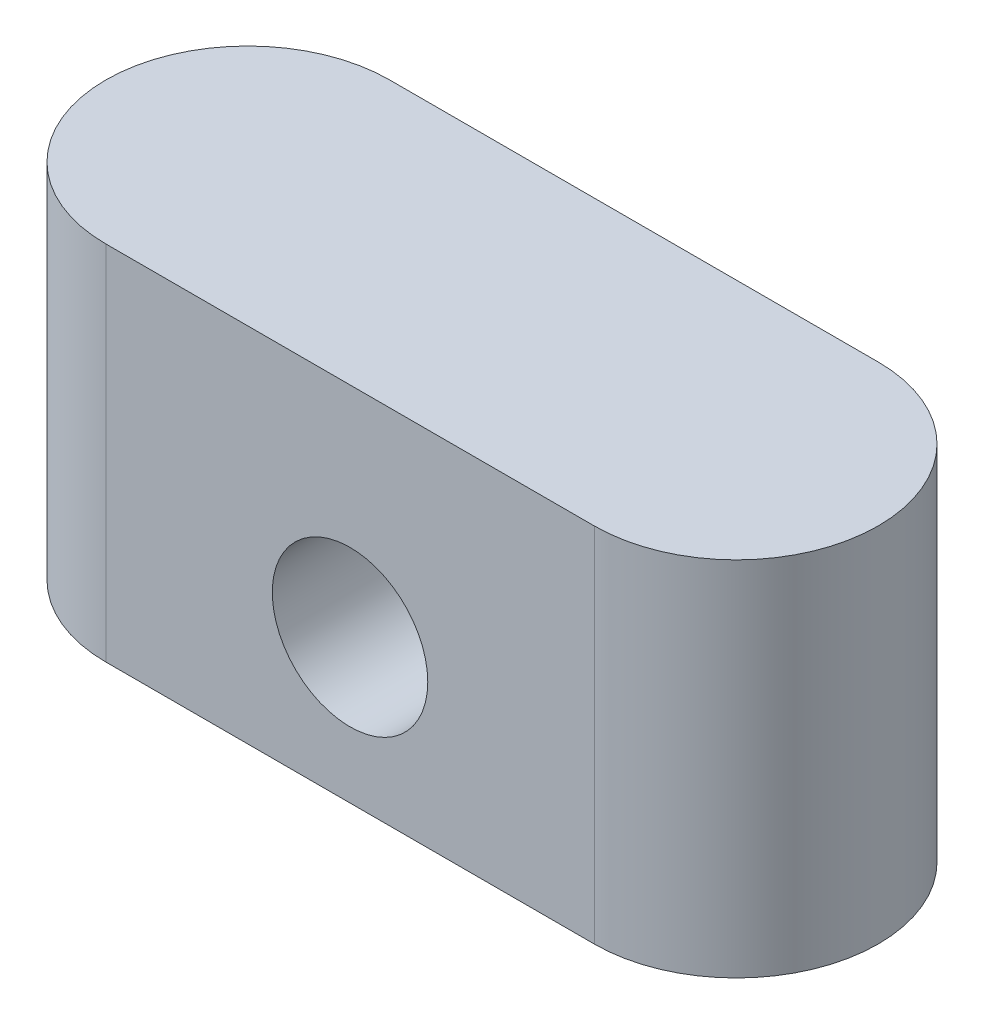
from build123d import *

# Parameters (mm, degrees)
BOSS_EXTRUDE1_DEPTH   = 3.15
F_6_32_TAPPED_HOLE1_D = 2.7051


with BuildPart() as part:
    # Sketch1 → Boss-Extrude1 (new, symmetric)
    with BuildSketch(Plane(origin=(0, 0, 0), x_dir=(1, 0, 0), z_dir=(0, 1, 0))):
        with BuildLine():
            Line((-4.25, 2.47015), (4.25, 2.47015))
            ThreePointArc((4.25, 2.47015), (6.72015, 0), (4.25, -2.47015))
            Line((4.25, -2.47015), (-4.25, -2.47015))
            ThreePointArc((-4.25, -2.47015), (-6.72015, 0), (-4.25, 2.47015))
        make_face()
    extrude(amount=BOSS_EXTRUDE1_DEPTH, both=True)

    # 6-32 Tapped Hole1 (through all)
    with Locations(Plane.XY.offset(2.47015)):
        with Locations((0, -0.65)):
            Hole(F_6_32_TAPPED_HOLE1_D / 2)


solid = part.part
